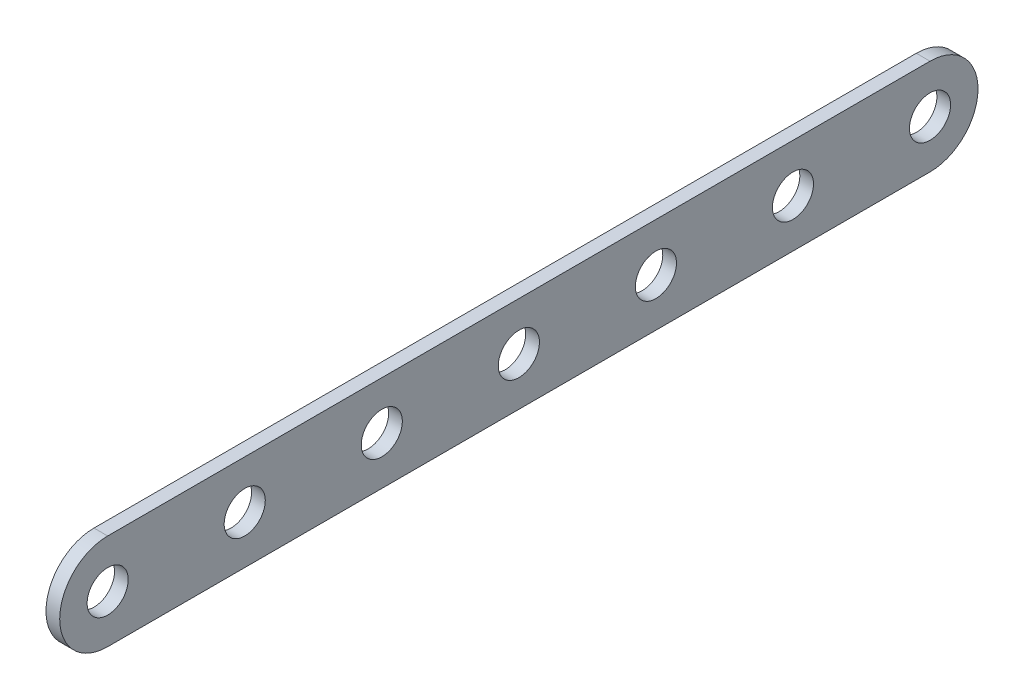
from build123d import *

# Parameters (mm, degrees)
ESQUISSE1_R        = 1.5
BOSS_EXTRU_1_DEPTH = 1


with BuildPart() as part:
    # Esquisse1 → Boss.-Extru.1 (new body)
    with BuildSketch(Plane(origin=(0, 0, 0), x_dir=(0, 0, -1), z_dir=(1, 0, 0))):
        with BuildLine():
            Line((0, 3.5), (60, 3.5))
            ThreePointArc((60, 3.5), (63.5, 0), (60, -3.5))
            Line((60, -3.5), (0, -3.5))
            ThreePointArc((0, -3.5), (-3.5, 0), (0, 3.5))
        make_face()
        Circle(ESQUISSE1_R, mode=Mode.SUBTRACT)
        with Locations((10, 0)):
            Circle(ESQUISSE1_R, mode=Mode.SUBTRACT)
        with Locations((20, 0)):
            Circle(ESQUISSE1_R, mode=Mode.SUBTRACT)
        with Locations((30, 0)):
            Circle(ESQUISSE1_R, mode=Mode.SUBTRACT)
        with Locations((40, 0)):
            Circle(ESQUISSE1_R, mode=Mode.SUBTRACT)
        with Locations((50, 0)):
            Circle(ESQUISSE1_R, mode=Mode.SUBTRACT)
        with Locations((60, 0)):
            Circle(ESQUISSE1_R, mode=Mode.SUBTRACT)
    extrude(amount=BOSS_EXTRU_1_DEPTH)


solid = part.part
